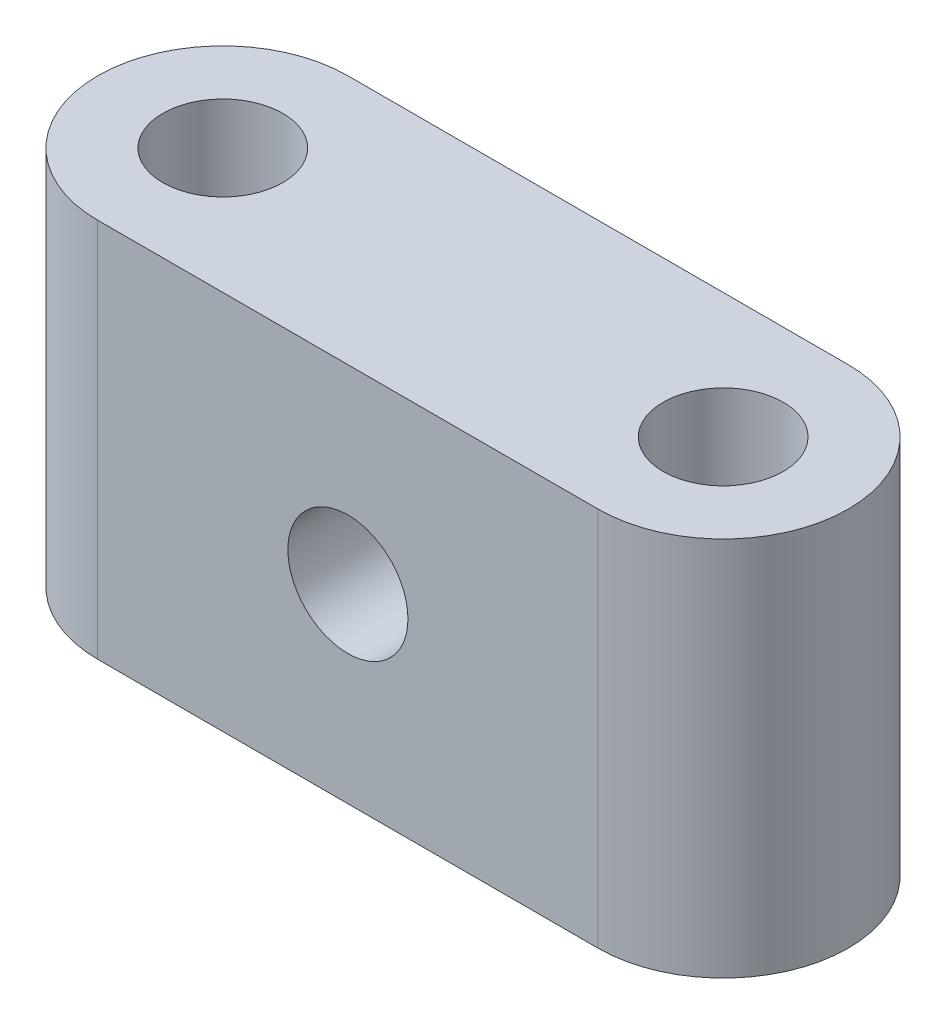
ISO-10303-21;
HEADER;
FILE_DESCRIPTION(('STEP AP214'),'2;1');
FILE_NAME('part.step','',(''),(''),'','','');
FILE_SCHEMA(('AUTOMOTIVE_DESIGN { 1 0 10303 214 1 1 1 1 }'));
ENDSEC;
DATA;
#1=APPLICATION_CONTEXT('core data for automotive mechanical design processes');
#2=APPLICATION_PROTOCOL_DEFINITION('international standard','automotive_design',2000,#1);
#3=PRODUCT_CONTEXT('',#1,'mechanical');
#4=PRODUCT('Part','Part','',(#3));
#5=PRODUCT_RELATED_PRODUCT_CATEGORY('part','',(#4));
#6=PRODUCT_DEFINITION_FORMATION('','',#4);
#7=PRODUCT_DEFINITION_CONTEXT('part definition',#1,'design');
#8=PRODUCT_DEFINITION('design','',#6,#7);
#9=PRODUCT_DEFINITION_SHAPE('','',#8);
#10=(LENGTH_UNIT() NAMED_UNIT(*) SI_UNIT(.MILLI.,.METRE.));
#11=(NAMED_UNIT(*) PLANE_ANGLE_UNIT() SI_UNIT($,.RADIAN.));
#12=(NAMED_UNIT(*) SI_UNIT($,.STERADIAN.) SOLID_ANGLE_UNIT());
#13=UNCERTAINTY_MEASURE_WITH_UNIT(LENGTH_MEASURE(1.E-05),#10,'distance_accuracy_value','');
#14=(GEOMETRIC_REPRESENTATION_CONTEXT(3) GLOBAL_UNCERTAINTY_ASSIGNED_CONTEXT((#13)) GLOBAL_UNIT_ASSIGNED_CONTEXT((#10,
#11,#12)) REPRESENTATION_CONTEXT('',''));
#15=CARTESIAN_POINT('',(0.,0.,0.));
#16=DIRECTION('',(0.,0.,1.));
#17=DIRECTION('',(1.,0.,0.));
#18=AXIS2_PLACEMENT_3D('',#15,#16,#17);
#19=CARTESIAN_POINT('',(0.,38.,0.));
#20=DIRECTION('',(0.,1.,0.));
#21=DIRECTION('',(0.,0.,1.));
#22=AXIS2_PLACEMENT_3D('',#19,#20,#21);
#23=PLANE('',#22);
#24=CARTESIAN_POINT('',(0.,38.,0.));
#25=DIRECTION('',(0.,1.,0.));
#26=DIRECTION('',(0.,0.,1.));
#27=AXIS2_PLACEMENT_3D('',#24,#25,#26);
#28=CIRCLE('',#27,6.);
#29=CARTESIAN_POINT('',(0.,38.,6.));
#30=VERTEX_POINT('',#29);
#31=EDGE_CURVE('E116',#30,#30,#28,.T.);
#32=ORIENTED_EDGE('',*,*,#31,.F.);
#33=EDGE_LOOP('',(#32));
#34=FACE_BOUND('',#33,.T.);
#35=CARTESIAN_POINT('',(0.,38.,0.));
#36=DIRECTION('',(0.,1.,0.));
#37=DIRECTION('',(0.,0.,1.));
#38=AXIS2_PLACEMENT_3D('',#35,#36,#37);
#39=CIRCLE('',#38,12.5);
#40=CARTESIAN_POINT('',(0.,38.,-12.5));
#41=VERTEX_POINT('',#40);
#42=CARTESIAN_POINT('',(0.,38.,12.5));
#43=VERTEX_POINT('',#42);
#44=EDGE_CURVE('E96',#41,#43,#39,.T.);
#45=ORIENTED_EDGE('',*,*,#44,.T.);
#46=DIRECTION('',(1.,0.,0.));
#47=VECTOR('',#46,1.);
#48=CARTESIAN_POINT('',(0.,38.,12.5));
#49=LINE('',#48,#47);
#50=CARTESIAN_POINT('',(50.,38.,12.5));
#51=VERTEX_POINT('',#50);
#52=EDGE_CURVE('E91',#43,#51,#49,.T.);
#53=ORIENTED_EDGE('',*,*,#52,.T.);
#54=CARTESIAN_POINT('',(50.,38.,0.));
#55=DIRECTION('',(0.,1.,0.));
#56=DIRECTION('',(0.,0.,1.));
#57=AXIS2_PLACEMENT_3D('',#54,#55,#56);
#58=CIRCLE('',#57,12.5);
#59=CARTESIAN_POINT('',(50.,38.,-12.5));
#60=VERTEX_POINT('',#59);
#61=EDGE_CURVE('E94',#51,#60,#58,.T.);
#62=ORIENTED_EDGE('',*,*,#61,.T.);
#63=DIRECTION('',(-1.,0.,0.));
#64=VECTOR('',#63,1.);
#65=CARTESIAN_POINT('',(0.,38.,-12.5));
#66=LINE('',#65,#64);
#67=EDGE_CURVE('E61',#60,#41,#66,.T.);
#68=ORIENTED_EDGE('',*,*,#67,.T.);
#69=EDGE_LOOP('',(#45,#53,#62,#68));
#70=FACE_BOUND('',#69,.T.);
#71=CARTESIAN_POINT('',(50.,38.,0.));
#72=DIRECTION('',(0.,1.,0.));
#73=DIRECTION('',(0.,0.,1.));
#74=AXIS2_PLACEMENT_3D('',#71,#72,#73);
#75=CIRCLE('',#74,6.);
#76=CARTESIAN_POINT('',(50.,38.,6.));
#77=VERTEX_POINT('',#76);
#78=EDGE_CURVE('E138',#77,#77,#75,.T.);
#79=ORIENTED_EDGE('',*,*,#78,.F.);
#80=EDGE_LOOP('',(#79));
#81=FACE_BOUND('',#80,.T.);
#82=ADVANCED_FACE('F43',(#34,#70,#81),#23,.T.);
#83=CARTESIAN_POINT('',(0.,0.,0.));
#84=DIRECTION('',(0.,1.,0.));
#85=DIRECTION('',(0.,0.,1.));
#86=AXIS2_PLACEMENT_3D('',#83,#84,#85);
#87=PLANE('',#86);
#88=CARTESIAN_POINT('',(0.,0.,0.));
#89=DIRECTION('',(0.,1.,0.));
#90=DIRECTION('',(0.,0.,1.));
#91=AXIS2_PLACEMENT_3D('',#88,#89,#90);
#92=CIRCLE('',#91,12.5);
#93=CARTESIAN_POINT('',(0.,0.,-12.5));
#94=VERTEX_POINT('',#93);
#95=CARTESIAN_POINT('',(0.,0.,12.5));
#96=VERTEX_POINT('',#95);
#97=EDGE_CURVE('E112',#94,#96,#92,.T.);
#98=ORIENTED_EDGE('',*,*,#97,.F.);
#99=DIRECTION('',(-1.,0.,0.));
#100=VECTOR('',#99,1.);
#101=CARTESIAN_POINT('',(0.,0.,-12.5));
#102=LINE('',#101,#100);
#103=CARTESIAN_POINT('',(50.,0.,-12.5));
#104=VERTEX_POINT('',#103);
#105=EDGE_CURVE('E84',#104,#94,#102,.T.);
#106=ORIENTED_EDGE('',*,*,#105,.F.);
#107=CARTESIAN_POINT('',(50.,0.,0.));
#108=DIRECTION('',(0.,1.,0.));
#109=DIRECTION('',(0.,0.,1.));
#110=AXIS2_PLACEMENT_3D('',#107,#108,#109);
#111=CIRCLE('',#110,12.5);
#112=CARTESIAN_POINT('',(50.,0.,12.5));
#113=VERTEX_POINT('',#112);
#114=EDGE_CURVE('E78',#113,#104,#111,.T.);
#115=ORIENTED_EDGE('',*,*,#114,.F.);
#116=DIRECTION('',(1.,0.,0.));
#117=VECTOR('',#116,1.);
#118=CARTESIAN_POINT('',(0.,0.,12.5));
#119=LINE('',#118,#117);
#120=EDGE_CURVE('E101',#96,#113,#119,.T.);
#121=ORIENTED_EDGE('',*,*,#120,.F.);
#122=EDGE_LOOP('',(#98,#106,#115,#121));
#123=FACE_BOUND('',#122,.T.);
#124=CARTESIAN_POINT('',(0.,0.,0.));
#125=DIRECTION('',(0.,1.,0.));
#126=DIRECTION('',(0.,0.,1.));
#127=AXIS2_PLACEMENT_3D('',#124,#125,#126);
#128=CIRCLE('',#127,6.);
#129=CARTESIAN_POINT('',(0.,0.,6.));
#130=VERTEX_POINT('',#129);
#131=EDGE_CURVE('E134',#130,#130,#128,.T.);
#132=ORIENTED_EDGE('',*,*,#131,.T.);
#133=EDGE_LOOP('',(#132));
#134=FACE_BOUND('',#133,.T.);
#135=CARTESIAN_POINT('',(50.,0.,0.));
#136=DIRECTION('',(0.,1.,0.));
#137=DIRECTION('',(0.,0.,1.));
#138=AXIS2_PLACEMENT_3D('',#135,#136,#137);
#139=CIRCLE('',#138,6.);
#140=CARTESIAN_POINT('',(50.,0.,6.));
#141=VERTEX_POINT('',#140);
#142=EDGE_CURVE('E142',#141,#141,#139,.T.);
#143=ORIENTED_EDGE('',*,*,#142,.T.);
#144=EDGE_LOOP('',(#143));
#145=FACE_BOUND('',#144,.T.);
#146=ADVANCED_FACE('F129',(#123,#134,#145),#87,.F.);
#147=CARTESIAN_POINT('',(0.,38.,0.));
#148=DIRECTION('',(0.,-1.,0.));
#149=DIRECTION('',(0.,0.,-1.));
#150=AXIS2_PLACEMENT_3D('',#147,#148,#149);
#151=CYLINDRICAL_SURFACE('',#150,12.5);
#152=ORIENTED_EDGE('',*,*,#97,.T.);
#153=DIRECTION('',(0.,-1.,0.));
#154=VECTOR('',#153,1.);
#155=CARTESIAN_POINT('',(0.,38.,12.5));
#156=LINE('',#155,#154);
#157=EDGE_CURVE('E11',#43,#96,#156,.T.);
#158=ORIENTED_EDGE('',*,*,#157,.F.);
#159=ORIENTED_EDGE('',*,*,#44,.F.);
#160=DIRECTION('',(0.,-1.,0.));
#161=VECTOR('',#160,1.);
#162=CARTESIAN_POINT('',(0.,38.,-12.5));
#163=LINE('',#162,#161);
#164=EDGE_CURVE('E108',#41,#94,#163,.T.);
#165=ORIENTED_EDGE('',*,*,#164,.T.);
#166=EDGE_LOOP('',(#152,#158,#159,#165));
#167=FACE_BOUND('',#166,.T.);
#168=ADVANCED_FACE('F45',(#167),#151,.T.);
#169=CARTESIAN_POINT('',(0.,38.,12.5));
#170=DIRECTION('',(0.,0.,-1.));
#171=DIRECTION('',(-1.,0.,0.));
#172=AXIS2_PLACEMENT_3D('',#169,#170,#171);
#173=PLANE('',#172);
#174=CARTESIAN_POINT('',(25.,19.,12.5));
#175=DIRECTION('',(0.,0.,1.));
#176=DIRECTION('',(1.,0.,0.));
#177=AXIS2_PLACEMENT_3D('',#174,#175,#176);
#178=CIRCLE('',#177,6.);
#179=CARTESIAN_POINT('',(31.,19.,12.5));
#180=VERTEX_POINT('',#179);
#181=EDGE_CURVE('E150',#180,#180,#178,.T.);
#182=ORIENTED_EDGE('',*,*,#181,.F.);
#183=EDGE_LOOP('',(#182));
#184=FACE_BOUND('',#183,.T.);
#185=ORIENTED_EDGE('',*,*,#120,.T.);
#186=DIRECTION('',(0.,-1.,0.));
#187=VECTOR('',#186,1.);
#188=CARTESIAN_POINT('',(50.,38.,12.5));
#189=LINE('',#188,#187);
#190=EDGE_CURVE('E53',#51,#113,#189,.T.);
#191=ORIENTED_EDGE('',*,*,#190,.F.);
#192=ORIENTED_EDGE('',*,*,#52,.F.);
#193=ORIENTED_EDGE('',*,*,#157,.T.);
#194=EDGE_LOOP('',(#185,#191,#192,#193));
#195=FACE_BOUND('',#194,.T.);
#196=ADVANCED_FACE('F100',(#184,#195),#173,.F.);
#197=CARTESIAN_POINT('',(50.,38.,0.));
#198=DIRECTION('',(0.,-1.,0.));
#199=DIRECTION('',(0.,0.,-1.));
#200=AXIS2_PLACEMENT_3D('',#197,#198,#199);
#201=CYLINDRICAL_SURFACE('',#200,12.5);
#202=ORIENTED_EDGE('',*,*,#114,.T.);
#203=DIRECTION('',(0.,-1.,0.));
#204=VECTOR('',#203,1.);
#205=CARTESIAN_POINT('',(50.,38.,-12.5));
#206=LINE('',#205,#204);
#207=EDGE_CURVE('E103',#60,#104,#206,.T.);
#208=ORIENTED_EDGE('',*,*,#207,.F.);
#209=ORIENTED_EDGE('',*,*,#61,.F.);
#210=ORIENTED_EDGE('',*,*,#190,.T.);
#211=EDGE_LOOP('',(#202,#208,#209,#210));
#212=FACE_BOUND('',#211,.T.);
#213=ADVANCED_FACE('F104',(#212),#201,.T.);
#214=CARTESIAN_POINT('',(0.,38.,-12.5));
#215=DIRECTION('',(0.,0.,1.));
#216=DIRECTION('',(1.,0.,0.));
#217=AXIS2_PLACEMENT_3D('',#214,#215,#216);
#218=PLANE('',#217);
#219=ORIENTED_EDGE('',*,*,#105,.T.);
#220=ORIENTED_EDGE('',*,*,#164,.F.);
#221=ORIENTED_EDGE('',*,*,#67,.F.);
#222=ORIENTED_EDGE('',*,*,#207,.T.);
#223=EDGE_LOOP('',(#219,#220,#221,#222));
#224=FACE_BOUND('',#223,.T.);
#225=ADVANCED_FACE('F126',(#224),#218,.F.);
#226=CARTESIAN_POINT('',(0.,38.,0.));
#227=DIRECTION('',(0.,-1.,0.));
#228=DIRECTION('',(0.,0.,-1.));
#229=AXIS2_PLACEMENT_3D('',#226,#227,#228);
#230=CYLINDRICAL_SURFACE('',#229,6.);
#231=ORIENTED_EDGE('',*,*,#31,.T.);
#232=EDGE_LOOP('',(#231));
#233=FACE_BOUND('',#232,.T.);
#234=ORIENTED_EDGE('',*,*,#131,.F.);
#235=EDGE_LOOP('',(#234));
#236=FACE_BOUND('',#235,.T.);
#237=ADVANCED_FACE('F182',(#233,#236),#230,.F.);
#238=CARTESIAN_POINT('',(50.,38.,0.));
#239=DIRECTION('',(0.,-1.,0.));
#240=DIRECTION('',(0.,0.,-1.));
#241=AXIS2_PLACEMENT_3D('',#238,#239,#240);
#242=CYLINDRICAL_SURFACE('',#241,6.);
#243=ORIENTED_EDGE('',*,*,#78,.T.);
#244=EDGE_LOOP('',(#243));
#245=FACE_BOUND('',#244,.T.);
#246=ORIENTED_EDGE('',*,*,#142,.F.);
#247=EDGE_LOOP('',(#246));
#248=FACE_BOUND('',#247,.T.);
#249=ADVANCED_FACE('F163',(#245,#248),#242,.F.);
#250=CARTESIAN_POINT('',(25.,19.,0.));
#251=DIRECTION('',(0.,0.,1.));
#252=DIRECTION('',(1.,0.,0.));
#253=AXIS2_PLACEMENT_3D('',#250,#251,#252);
#254=CYLINDRICAL_SURFACE('',#253,6.);
#255=CARTESIAN_POINT('',(25.,19.,0.));
#256=DIRECTION('',(0.,0.,1.));
#257=DIRECTION('',(1.,0.,0.));
#258=AXIS2_PLACEMENT_3D('',#255,#256,#257);
#259=CIRCLE('',#258,6.);
#260=CARTESIAN_POINT('',(31.,19.,0.));
#261=VERTEX_POINT('',#260);
#262=EDGE_CURVE('E146',#261,#261,#259,.T.);
#263=ORIENTED_EDGE('',*,*,#262,.F.);
#264=EDGE_LOOP('',(#263));
#265=FACE_BOUND('',#264,.T.);
#266=ORIENTED_EDGE('',*,*,#181,.T.);
#267=EDGE_LOOP('',(#266));
#268=FACE_BOUND('',#267,.T.);
#269=ADVANCED_FACE('F160',(#265,#268),#254,.F.);
#270=CARTESIAN_POINT('',(25.,19.,0.));
#271=DIRECTION('',(0.,0.,1.));
#272=DIRECTION('',(1.,0.,0.));
#273=AXIS2_PLACEMENT_3D('',#270,#271,#272);
#274=PLANE('',#273);
#275=ORIENTED_EDGE('',*,*,#262,.T.);
#276=EDGE_LOOP('',(#275));
#277=FACE_BOUND('',#276,.T.);
#278=ADVANCED_FACE('F158',(#277),#274,.T.);
#279=CLOSED_SHELL('',(#82,#146,#168,#196,#213,#225,#237,#249,#269,#278));
#280=MANIFOLD_SOLID_BREP('B2',#279);
#281=ADVANCED_BREP_SHAPE_REPRESENTATION('',(#18,#280),#14);
#282=SHAPE_DEFINITION_REPRESENTATION(#9,#281);
ENDSEC;
END-ISO-10303-21;
